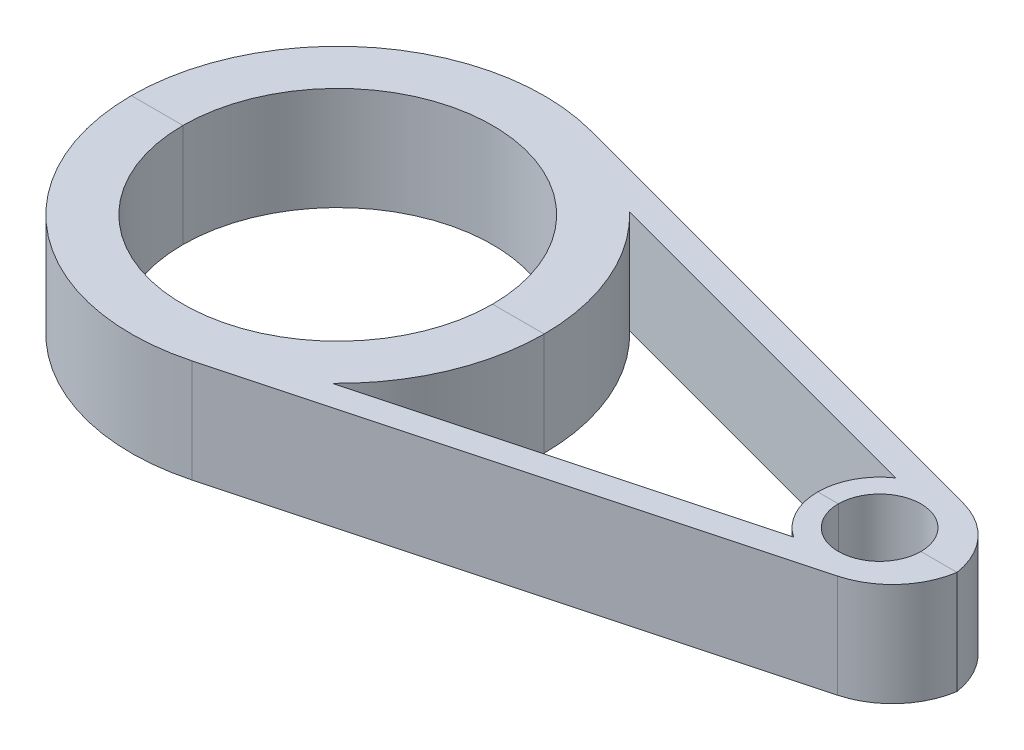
ISO-10303-21;
HEADER;
FILE_DESCRIPTION(('STEP AP214'),'2;1');
FILE_NAME('part.step','',(''),(''),'','','');
FILE_SCHEMA(('AUTOMOTIVE_DESIGN { 1 0 10303 214 1 1 1 1 }'));
ENDSEC;
DATA;
#1=APPLICATION_CONTEXT('core data for automotive mechanical design processes');
#2=APPLICATION_PROTOCOL_DEFINITION('international standard','automotive_design',2000,#1);
#3=PRODUCT_CONTEXT('',#1,'mechanical');
#4=PRODUCT('Part','Part','',(#3));
#5=PRODUCT_RELATED_PRODUCT_CATEGORY('part','',(#4));
#6=PRODUCT_DEFINITION_FORMATION('','',#4);
#7=PRODUCT_DEFINITION_CONTEXT('part definition',#1,'design');
#8=PRODUCT_DEFINITION('design','',#6,#7);
#9=PRODUCT_DEFINITION_SHAPE('','',#8);
#10=(LENGTH_UNIT() NAMED_UNIT(*) SI_UNIT(.MILLI.,.METRE.));
#11=(NAMED_UNIT(*) PLANE_ANGLE_UNIT() SI_UNIT($,.RADIAN.));
#12=(NAMED_UNIT(*) SI_UNIT($,.STERADIAN.) SOLID_ANGLE_UNIT());
#13=UNCERTAINTY_MEASURE_WITH_UNIT(LENGTH_MEASURE(1.E-05),#10,'distance_accuracy_value','');
#14=(GEOMETRIC_REPRESENTATION_CONTEXT(3) GLOBAL_UNCERTAINTY_ASSIGNED_CONTEXT((#13)) GLOBAL_UNIT_ASSIGNED_CONTEXT((#10,
#11,#12)) REPRESENTATION_CONTEXT('',''));
#15=CARTESIAN_POINT('',(0.,0.,0.));
#16=DIRECTION('',(0.,0.,1.));
#17=DIRECTION('',(1.,0.,0.));
#18=AXIS2_PLACEMENT_3D('',#15,#16,#17);
#19=CARTESIAN_POINT('',(97.,20.,0.));
#20=DIRECTION('',(0.,0.,1.));
#21=DIRECTION('',(-1.,0.,0.));
#22=AXIS2_PLACEMENT_3D('',#19,#20,#21);
#23=PLANE('',#22);
#24=DIRECTION('',(1.,0.,0.));
#25=VECTOR('',#24,1.);
#26=CARTESIAN_POINT('',(97.,20.,0.));
#27=LINE('',#26,#25);
#28=CARTESIAN_POINT('',(93.,20.,0.));
#29=VERTEX_POINT('',#28);
#30=CARTESIAN_POINT('',(97.,20.,0.));
#31=VERTEX_POINT('',#30);
#32=EDGE_CURVE('E150',#29,#31,#27,.T.);
#33=ORIENTED_EDGE('',*,*,#32,.T.);
#34=DIRECTION('',(0.,-1.,0.));
#35=VECTOR('',#34,1.);
#36=CARTESIAN_POINT('',(97.,20.,0.));
#37=LINE('',#36,#35);
#38=CARTESIAN_POINT('',(97.,0.,0.));
#39=VERTEX_POINT('',#38);
#40=EDGE_CURVE('E224',#31,#39,#37,.T.);
#41=ORIENTED_EDGE('',*,*,#40,.T.);
#42=DIRECTION('',(1.,0.,0.));
#43=VECTOR('',#42,1.);
#44=CARTESIAN_POINT('',(97.,0.,0.));
#45=LINE('',#44,#43);
#46=CARTESIAN_POINT('',(93.,0.,0.));
#47=VERTEX_POINT('',#46);
#48=EDGE_CURVE('E176',#47,#39,#45,.T.);
#49=ORIENTED_EDGE('',*,*,#48,.F.);
#50=DIRECTION('',(0.,1.,0.));
#51=VECTOR('',#50,1.);
#52=CARTESIAN_POINT('',(93.,0.,0.));
#53=LINE('',#52,#51);
#54=EDGE_CURVE('E161',#47,#29,#53,.T.);
#55=ORIENTED_EDGE('',*,*,#54,.T.);
#56=EDGE_LOOP('',(#33,#41,#49,#55));
#57=FACE_BOUND('',#56,.T.);
#58=ADVANCED_FACE('F43',(#57),#23,.F.);
#59=CARTESIAN_POINT('',(0.,20.,0.));
#60=DIRECTION('',(0.,-1.,0.));
#61=DIRECTION('',(0.,0.,1.));
#62=AXIS2_PLACEMENT_3D('',#59,#60,#61);
#63=CYLINDRICAL_SURFACE('',#62,40.);
#64=CARTESIAN_POINT('',(0.,0.,0.));
#65=DIRECTION('',(0.,-1.,0.));
#66=DIRECTION('',(0.,0.,1.));
#67=AXIS2_PLACEMENT_3D('',#64,#65,#66);
#68=CIRCLE('',#67,40.);
#69=CARTESIAN_POINT('',(10.3527618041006,0.,38.6370330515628));
#70=VERTEX_POINT('',#69);
#71=CARTESIAN_POINT('',(-40.,0.,0.));
#72=VERTEX_POINT('',#71);
#73=EDGE_CURVE('E163',#70,#72,#68,.T.);
#74=ORIENTED_EDGE('',*,*,#73,.F.);
#75=DIRECTION('',(0.,-1.,0.));
#76=VECTOR('',#75,1.);
#77=CARTESIAN_POINT('',(10.3527618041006,20.,38.6370330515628));
#78=LINE('',#77,#76);
#79=CARTESIAN_POINT('',(10.3527618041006,20.,38.6370330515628));
#80=VERTEX_POINT('',#79);
#81=EDGE_CURVE('E213',#80,#70,#78,.T.);
#82=ORIENTED_EDGE('',*,*,#81,.F.);
#83=CARTESIAN_POINT('',(0.,20.,0.));
#84=DIRECTION('',(0.,-1.,0.));
#85=DIRECTION('',(0.,0.,1.));
#86=AXIS2_PLACEMENT_3D('',#83,#84,#85);
#87=CIRCLE('',#86,40.);
#88=CARTESIAN_POINT('',(-40.,20.,0.));
#89=VERTEX_POINT('',#88);
#90=EDGE_CURVE('E191',#80,#89,#87,.T.);
#91=ORIENTED_EDGE('',*,*,#90,.T.);
#92=DIRECTION('',(0.,-1.,0.));
#93=VECTOR('',#92,1.);
#94=CARTESIAN_POINT('',(-40.,20.,0.));
#95=LINE('',#94,#93);
#96=EDGE_CURVE('E12',#89,#72,#95,.T.);
#97=ORIENTED_EDGE('',*,*,#96,.T.);
#98=EDGE_LOOP('',(#74,#82,#91,#97));
#99=FACE_BOUND('',#98,.T.);
#100=ADVANCED_FACE('F45',(#99),#63,.T.);
#101=CARTESIAN_POINT('',(-30.,20.,0.));
#102=DIRECTION('',(0.,0.,1.));
#103=DIRECTION('',(-1.,0.,0.));
#104=AXIS2_PLACEMENT_3D('',#101,#102,#103);
#105=PLANE('',#104);
#106=DIRECTION('',(1.,0.,0.));
#107=VECTOR('',#106,1.);
#108=CARTESIAN_POINT('',(-30.,0.,0.));
#109=LINE('',#108,#107);
#110=CARTESIAN_POINT('',(-30.,0.,0.));
#111=VERTEX_POINT('',#110);
#112=EDGE_CURVE('E170',#72,#111,#109,.T.);
#113=ORIENTED_EDGE('',*,*,#112,.F.);
#114=ORIENTED_EDGE('',*,*,#96,.F.);
#115=DIRECTION('',(1.,0.,0.));
#116=VECTOR('',#115,1.);
#117=CARTESIAN_POINT('',(-30.,20.,0.));
#118=LINE('',#117,#116);
#119=CARTESIAN_POINT('',(-30.,20.,0.));
#120=VERTEX_POINT('',#119);
#121=EDGE_CURVE('E194',#89,#120,#118,.T.);
#122=ORIENTED_EDGE('',*,*,#121,.T.);
#123=DIRECTION('',(0.,-1.,0.));
#124=VECTOR('',#123,1.);
#125=CARTESIAN_POINT('',(-30.,20.,0.));
#126=LINE('',#125,#124);
#127=EDGE_CURVE('E51',#120,#111,#126,.T.);
#128=ORIENTED_EDGE('',*,*,#127,.T.);
#129=EDGE_LOOP('',(#113,#114,#122,#128));
#130=FACE_BOUND('',#129,.T.);
#131=ADVANCED_FACE('F232',(#130),#105,.F.);
#132=CARTESIAN_POINT('',(0.,20.,0.));
#133=DIRECTION('',(0.,-1.,0.));
#134=DIRECTION('',(0.,0.,1.));
#135=AXIS2_PLACEMENT_3D('',#132,#133,#134);
#136=CYLINDRICAL_SURFACE('',#135,30.);
#137=CARTESIAN_POINT('',(0.,0.,0.));
#138=DIRECTION('',(0.,1.,0.));
#139=DIRECTION('',(0.,0.,1.));
#140=AXIS2_PLACEMENT_3D('',#137,#138,#139);
#141=CIRCLE('',#140,30.);
#142=CARTESIAN_POINT('',(30.,0.,0.));
#143=VERTEX_POINT('',#142);
#144=EDGE_CURVE('E173',#111,#143,#141,.T.);
#145=ORIENTED_EDGE('',*,*,#144,.F.);
#146=ORIENTED_EDGE('',*,*,#127,.F.);
#147=CARTESIAN_POINT('',(0.,20.,0.));
#148=DIRECTION('',(0.,1.,0.));
#149=DIRECTION('',(0.,0.,1.));
#150=AXIS2_PLACEMENT_3D('',#147,#148,#149);
#151=CIRCLE('',#150,30.);
#152=CARTESIAN_POINT('',(30.,20.,0.));
#153=VERTEX_POINT('',#152);
#154=EDGE_CURVE('E197',#120,#153,#151,.T.);
#155=ORIENTED_EDGE('',*,*,#154,.T.);
#156=DIRECTION('',(0.,-1.,0.));
#157=VECTOR('',#156,1.);
#158=CARTESIAN_POINT('',(30.,20.,0.));
#159=LINE('',#158,#157);
#160=EDGE_CURVE('E227',#153,#143,#159,.T.);
#161=ORIENTED_EDGE('',*,*,#160,.T.);
#162=EDGE_LOOP('',(#145,#146,#155,#161));
#163=FACE_BOUND('',#162,.T.);
#164=ADVANCED_FACE('F241',(#163),#136,.F.);
#165=CARTESIAN_POINT('',(40.,0.,0.));
#166=VERTEX_POINT('',#165);
#167=EDGE_CURVE('E177',#143,#166,#45,.T.);
#168=ORIENTED_EDGE('',*,*,#167,.F.);
#169=ORIENTED_EDGE('',*,*,#160,.F.);
#170=CARTESIAN_POINT('',(40.,20.,0.));
#171=VERTEX_POINT('',#170);
#172=EDGE_CURVE('E200',#153,#171,#27,.T.);
#173=ORIENTED_EDGE('',*,*,#172,.T.);
#174=DIRECTION('',(0.,1.,0.));
#175=VECTOR('',#174,1.);
#176=CARTESIAN_POINT('',(40.,0.,0.));
#177=LINE('',#176,#175);
#178=EDGE_CURVE('E164',#166,#171,#177,.T.);
#179=ORIENTED_EDGE('',*,*,#178,.F.);
#180=EDGE_LOOP('',(#168,#169,#173,#179));
#181=FACE_BOUND('',#180,.T.);
#182=ADVANCED_FACE('F243',(#181),#23,.F.);
#183=CARTESIAN_POINT('',(105.,20.,0.));
#184=DIRECTION('',(0.,-1.,0.));
#185=DIRECTION('',(0.,0.,1.));
#186=AXIS2_PLACEMENT_3D('',#183,#184,#185);
#187=CYLINDRICAL_SURFACE('',#186,7.99999999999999);
#188=CARTESIAN_POINT('',(105.,0.,0.));
#189=DIRECTION('',(0.,1.,0.));
#190=DIRECTION('',(0.,0.,1.));
#191=AXIS2_PLACEMENT_3D('',#188,#189,#190);
#192=CIRCLE('',#191,7.99999999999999);
#193=CARTESIAN_POINT('',(113.,0.,0.));
#194=VERTEX_POINT('',#193);
#195=EDGE_CURVE('E180',#39,#194,#192,.T.);
#196=ORIENTED_EDGE('',*,*,#195,.F.);
#197=ORIENTED_EDGE('',*,*,#40,.F.);
#198=CARTESIAN_POINT('',(105.,20.,0.));
#199=DIRECTION('',(0.,1.,0.));
#200=DIRECTION('',(0.,0.,1.));
#201=AXIS2_PLACEMENT_3D('',#198,#199,#200);
#202=CIRCLE('',#201,7.99999999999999);
#203=CARTESIAN_POINT('',(113.,20.,0.));
#204=VERTEX_POINT('',#203);
#205=EDGE_CURVE('E203',#31,#204,#202,.T.);
#206=ORIENTED_EDGE('',*,*,#205,.T.);
#207=DIRECTION('',(0.,-1.,0.));
#208=VECTOR('',#207,1.);
#209=CARTESIAN_POINT('',(113.,20.,0.));
#210=LINE('',#209,#208);
#211=EDGE_CURVE('E221',#204,#194,#210,.T.);
#212=ORIENTED_EDGE('',*,*,#211,.T.);
#213=EDGE_LOOP('',(#196,#197,#206,#212));
#214=FACE_BOUND('',#213,.T.);
#215=ADVANCED_FACE('F264',(#214),#187,.F.);
#216=CARTESIAN_POINT('',(120.,20.,-1.03141099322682E-13));
#217=DIRECTION('',(0.,0.,1.));
#218=DIRECTION('',(-1.,0.,0.));
#219=AXIS2_PLACEMENT_3D('',#216,#217,#218);
#220=PLANE('',#219);
#221=DIRECTION('',(1.,0.,0.));
#222=VECTOR('',#221,1.);
#223=CARTESIAN_POINT('',(120.,0.,-1.03141099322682E-13));
#224=LINE('',#223,#222);
#225=CARTESIAN_POINT('',(120.,0.,-1.03141099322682E-13));
#226=VERTEX_POINT('',#225);
#227=EDGE_CURVE('E183',#194,#226,#224,.T.);
#228=ORIENTED_EDGE('',*,*,#227,.F.);
#229=ORIENTED_EDGE('',*,*,#211,.F.);
#230=DIRECTION('',(1.,0.,0.));
#231=VECTOR('',#230,1.);
#232=CARTESIAN_POINT('',(120.,20.,-1.03141099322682E-13));
#233=LINE('',#232,#231);
#234=CARTESIAN_POINT('',(120.,20.,-1.03141099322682E-13));
#235=VERTEX_POINT('',#234);
#236=EDGE_CURVE('E206',#204,#235,#233,.T.);
#237=ORIENTED_EDGE('',*,*,#236,.T.);
#238=DIRECTION('',(0.,-1.,0.));
#239=VECTOR('',#238,1.);
#240=CARTESIAN_POINT('',(120.,20.,-1.03141099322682E-13));
#241=LINE('',#240,#239);
#242=EDGE_CURVE('E218',#235,#226,#241,.T.);
#243=ORIENTED_EDGE('',*,*,#242,.T.);
#244=EDGE_LOOP('',(#228,#229,#237,#243));
#245=FACE_BOUND('',#244,.T.);
#246=ADVANCED_FACE('F269',(#245),#220,.F.);
#247=CARTESIAN_POINT('',(105.177429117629,20.,-2.30030268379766));
#248=DIRECTION('',(0.,-1.,0.));
#249=DIRECTION('',(0.,0.,1.));
#250=AXIS2_PLACEMENT_3D('',#247,#248,#249);
#251=CYLINDRICAL_SURFACE('',#250,15.);
#252=CARTESIAN_POINT('',(105.177429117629,0.,-2.30030268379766));
#253=DIRECTION('',(0.,-1.,0.));
#254=DIRECTION('',(0.,0.,1.));
#255=AXIS2_PLACEMENT_3D('',#252,#253,#254);
#256=CIRCLE('',#255,15.);
#257=CARTESIAN_POINT('',(109.059714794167,0.,12.1885847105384));
#258=VERTEX_POINT('',#257);
#259=EDGE_CURVE('E186',#226,#258,#256,.T.);
#260=ORIENTED_EDGE('',*,*,#259,.F.);
#261=ORIENTED_EDGE('',*,*,#242,.F.);
#262=CARTESIAN_POINT('',(105.177429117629,20.,-2.30030268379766));
#263=DIRECTION('',(0.,-1.,0.));
#264=DIRECTION('',(0.,0.,1.));
#265=AXIS2_PLACEMENT_3D('',#262,#263,#264);
#266=CIRCLE('',#265,15.);
#267=CARTESIAN_POINT('',(109.059714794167,20.,12.1885847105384));
#268=VERTEX_POINT('',#267);
#269=EDGE_CURVE('E209',#235,#268,#266,.T.);
#270=ORIENTED_EDGE('',*,*,#269,.T.);
#271=DIRECTION('',(0.,-1.,0.));
#272=VECTOR('',#271,1.);
#273=CARTESIAN_POINT('',(109.059714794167,20.,12.1885847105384));
#274=LINE('',#273,#272);
#275=EDGE_CURVE('E215',#268,#258,#274,.T.);
#276=ORIENTED_EDGE('',*,*,#275,.T.);
#277=EDGE_LOOP('',(#260,#261,#270,#276));
#278=FACE_BOUND('',#277,.T.);
#279=ADVANCED_FACE('F309',(#278),#251,.T.);
#280=CARTESIAN_POINT('',(10.3527618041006,20.,38.6370330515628));
#281=DIRECTION('',(-0.258819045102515,0.,-0.96592582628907));
#282=DIRECTION('',(0.96592582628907,0.,-0.258819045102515));
#283=AXIS2_PLACEMENT_3D('',#280,#281,#282);
#284=PLANE('',#283);
#285=DIRECTION('',(-0.96592582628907,0.,0.258819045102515));
#286=VECTOR('',#285,1.);
#287=CARTESIAN_POINT('',(10.3527618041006,0.,38.6370330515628));
#288=LINE('',#287,#286);
#289=EDGE_CURVE('E189',#258,#70,#288,.T.);
#290=ORIENTED_EDGE('',*,*,#289,.F.);
#291=ORIENTED_EDGE('',*,*,#275,.F.);
#292=DIRECTION('',(-0.96592582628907,0.,0.258819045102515));
#293=VECTOR('',#292,1.);
#294=CARTESIAN_POINT('',(10.3527618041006,20.,38.6370330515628));
#295=LINE('',#294,#293);
#296=EDGE_CURVE('E66',#268,#80,#295,.T.);
#297=ORIENTED_EDGE('',*,*,#296,.T.);
#298=ORIENTED_EDGE('',*,*,#81,.T.);
#299=EDGE_LOOP('',(#290,#291,#297,#298));
#300=FACE_BOUND('',#299,.T.);
#301=ADVANCED_FACE('F318',(#300),#284,.F.);
#302=CARTESIAN_POINT('',(0.,20.,0.));
#303=DIRECTION('',(0.,-1.,0.));
#304=DIRECTION('',(0.,0.,1.));
#305=AXIS2_PLACEMENT_3D('',#302,#303,#304);
#306=PLANE('',#305);
#307=DIRECTION('',(-0.96592582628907,0.,0.258819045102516));
#308=VECTOR('',#307,1.);
#309=CARTESIAN_POINT('',(98.2364011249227,20.,9.91230196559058));
#310=LINE('',#309,#308);
#311=CARTESIAN_POINT('',(98.2364011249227,20.,9.91230196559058));
#312=VERTEX_POINT('',#311);
#313=CARTESIAN_POINT('',(27.763739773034,20.,28.7953946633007));
#314=VERTEX_POINT('',#313);
#315=EDGE_CURVE('E148',#312,#314,#310,.T.);
#316=ORIENTED_EDGE('',*,*,#315,.T.);
#317=CARTESIAN_POINT('',(0.,20.,0.));
#318=DIRECTION('',(0.,1.,0.));
#319=DIRECTION('',(0.,0.,-1.));
#320=AXIS2_PLACEMENT_3D('',#317,#318,#319);
#321=CIRCLE('',#320,40.);
#322=EDGE_CURVE('E153',#314,#171,#321,.T.);
#323=ORIENTED_EDGE('',*,*,#322,.T.);
#324=ORIENTED_EDGE('',*,*,#172,.F.);
#325=ORIENTED_EDGE('',*,*,#154,.F.);
#326=ORIENTED_EDGE('',*,*,#121,.F.);
#327=ORIENTED_EDGE('',*,*,#90,.F.);
#328=ORIENTED_EDGE('',*,*,#296,.F.);
#329=ORIENTED_EDGE('',*,*,#269,.F.);
#330=ORIENTED_EDGE('',*,*,#236,.F.);
#331=ORIENTED_EDGE('',*,*,#205,.F.);
#332=ORIENTED_EDGE('',*,*,#32,.F.);
#333=CARTESIAN_POINT('',(105.,20.,0.));
#334=DIRECTION('',(0.,1.,0.));
#335=DIRECTION('',(0.,0.,-1.));
#336=AXIS2_PLACEMENT_3D('',#333,#334,#335);
#337=CIRCLE('',#336,12.);
#338=EDGE_CURVE('E136',#29,#312,#337,.T.);
#339=ORIENTED_EDGE('',*,*,#338,.T.);
#340=EDGE_LOOP('',(#316,#323,#324,#325,#326,#327,#328,#329,#330,#331,#332,#339));
#341=FACE_BOUND('',#340,.T.);
#342=ADVANCED_FACE('F147',(#341),#306,.F.);
#343=CARTESIAN_POINT('',(0.,0.,0.));
#344=DIRECTION('',(0.,-1.,0.));
#345=DIRECTION('',(0.,0.,1.));
#346=AXIS2_PLACEMENT_3D('',#343,#344,#345);
#347=PLANE('',#346);
#348=CARTESIAN_POINT('',(105.,0.,0.));
#349=DIRECTION('',(0.,1.,0.));
#350=DIRECTION('',(0.,0.,-1.));
#351=AXIS2_PLACEMENT_3D('',#348,#349,#350);
#352=CIRCLE('',#351,12.);
#353=CARTESIAN_POINT('',(98.2364011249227,0.,9.91230196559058));
#354=VERTEX_POINT('',#353);
#355=EDGE_CURVE('E138',#47,#354,#352,.T.);
#356=ORIENTED_EDGE('',*,*,#355,.F.);
#357=ORIENTED_EDGE('',*,*,#48,.T.);
#358=ORIENTED_EDGE('',*,*,#195,.T.);
#359=ORIENTED_EDGE('',*,*,#227,.T.);
#360=ORIENTED_EDGE('',*,*,#259,.T.);
#361=ORIENTED_EDGE('',*,*,#289,.T.);
#362=ORIENTED_EDGE('',*,*,#73,.T.);
#363=ORIENTED_EDGE('',*,*,#112,.T.);
#364=ORIENTED_EDGE('',*,*,#144,.T.);
#365=ORIENTED_EDGE('',*,*,#167,.T.);
#366=CARTESIAN_POINT('',(0.,0.,0.));
#367=DIRECTION('',(0.,1.,0.));
#368=DIRECTION('',(0.,0.,-1.));
#369=AXIS2_PLACEMENT_3D('',#366,#367,#368);
#370=CIRCLE('',#369,40.);
#371=CARTESIAN_POINT('',(27.763739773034,0.,28.7953946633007));
#372=VERTEX_POINT('',#371);
#373=EDGE_CURVE('E142',#372,#166,#370,.T.);
#374=ORIENTED_EDGE('',*,*,#373,.F.);
#375=DIRECTION('',(-0.96592582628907,0.,0.258819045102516));
#376=VECTOR('',#375,1.);
#377=CARTESIAN_POINT('',(98.2364011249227,0.,9.91230196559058));
#378=LINE('',#377,#376);
#379=EDGE_CURVE('E158',#354,#372,#378,.T.);
#380=ORIENTED_EDGE('',*,*,#379,.F.);
#381=EDGE_LOOP('',(#356,#357,#358,#359,#360,#361,#362,#363,#364,#365,#374,#380));
#382=FACE_BOUND('',#381,.T.);
#383=ADVANCED_FACE('F236',(#382),#347,.T.);
#384=CARTESIAN_POINT('',(105.,0.,0.));
#385=DIRECTION('',(0.,1.,0.));
#386=DIRECTION('',(0.,0.,-1.));
#387=AXIS2_PLACEMENT_3D('',#384,#385,#386);
#388=CYLINDRICAL_SURFACE('',#387,12.);
#389=ORIENTED_EDGE('',*,*,#338,.F.);
#390=ORIENTED_EDGE('',*,*,#54,.F.);
#391=ORIENTED_EDGE('',*,*,#355,.T.);
#392=DIRECTION('',(0.,1.,0.));
#393=VECTOR('',#392,1.);
#394=CARTESIAN_POINT('',(98.2364011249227,0.,9.91230196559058));
#395=LINE('',#394,#393);
#396=EDGE_CURVE('E132',#354,#312,#395,.T.);
#397=ORIENTED_EDGE('',*,*,#396,.T.);
#398=EDGE_LOOP('',(#389,#390,#391,#397));
#399=FACE_BOUND('',#398,.T.);
#400=ADVANCED_FACE('F134',(#399),#388,.T.);
#401=CARTESIAN_POINT('',(0.,0.,0.));
#402=DIRECTION('',(0.,1.,0.));
#403=DIRECTION('',(0.,0.,-1.));
#404=AXIS2_PLACEMENT_3D('',#401,#402,#403);
#405=CYLINDRICAL_SURFACE('',#404,40.);
#406=ORIENTED_EDGE('',*,*,#322,.F.);
#407=DIRECTION('',(0.,1.,0.));
#408=VECTOR('',#407,1.);
#409=CARTESIAN_POINT('',(27.763739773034,0.,28.7953946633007));
#410=LINE('',#409,#408);
#411=EDGE_CURVE('E58',#372,#314,#410,.T.);
#412=ORIENTED_EDGE('',*,*,#411,.F.);
#413=ORIENTED_EDGE('',*,*,#373,.T.);
#414=ORIENTED_EDGE('',*,*,#178,.T.);
#415=EDGE_LOOP('',(#406,#412,#413,#414));
#416=FACE_BOUND('',#415,.T.);
#417=ADVANCED_FACE('F246',(#416),#405,.T.);
#418=CARTESIAN_POINT('',(98.2364011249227,0.,9.91230196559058));
#419=DIRECTION('',(0.258819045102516,0.,0.96592582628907));
#420=DIRECTION('',(-0.96592582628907,0.,0.258819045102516));
#421=AXIS2_PLACEMENT_3D('',#418,#419,#420);
#422=PLANE('',#421);
#423=ORIENTED_EDGE('',*,*,#315,.F.);
#424=ORIENTED_EDGE('',*,*,#396,.F.);
#425=ORIENTED_EDGE('',*,*,#379,.T.);
#426=ORIENTED_EDGE('',*,*,#411,.T.);
#427=EDGE_LOOP('',(#423,#424,#425,#426));
#428=FACE_BOUND('',#427,.T.);
#429=ADVANCED_FACE('F152',(#428),#422,.F.);
#430=CLOSED_SHELL('',(#58,#100,#131,#164,#182,#215,#246,#279,#301,#342,#383,#400,#417,#429));
#431=MANIFOLD_SOLID_BREP('B2',#430);
#432=CARTESIAN_POINT('',(97.,20.,0.));
#433=DIRECTION('',(0.,0.,-1.));
#434=DIRECTION('',(-1.,0.,0.));
#435=AXIS2_PLACEMENT_3D('',#432,#433,#434);
#436=PLANE('',#435);
#437=DIRECTION('',(1.,0.,0.));
#438=VECTOR('',#437,1.);
#439=CARTESIAN_POINT('',(97.,20.,0.));
#440=LINE('',#439,#438);
#441=CARTESIAN_POINT('',(93.,20.,0.));
#442=VERTEX_POINT('',#441);
#443=CARTESIAN_POINT('',(97.,20.,0.));
#444=VERTEX_POINT('',#443);
#445=EDGE_CURVE('E521',#442,#444,#440,.T.);
#446=ORIENTED_EDGE('',*,*,#445,.F.);
#447=DIRECTION('',(0.,1.,0.));
#448=VECTOR('',#447,1.);
#449=CARTESIAN_POINT('',(93.,0.,0.));
#450=LINE('',#449,#448);
#451=CARTESIAN_POINT('',(93.,0.,0.));
#452=VERTEX_POINT('',#451);
#453=EDGE_CURVE('E478',#452,#442,#450,.T.);
#454=ORIENTED_EDGE('',*,*,#453,.F.);
#455=DIRECTION('',(1.,0.,0.));
#456=VECTOR('',#455,1.);
#457=CARTESIAN_POINT('',(97.,0.,0.));
#458=LINE('',#457,#456);
#459=CARTESIAN_POINT('',(97.,0.,0.));
#460=VERTEX_POINT('',#459);
#461=EDGE_CURVE('E503',#452,#460,#458,.T.);
#462=ORIENTED_EDGE('',*,*,#461,.T.);
#463=DIRECTION('',(0.,-1.,0.));
#464=VECTOR('',#463,1.);
#465=CARTESIAN_POINT('',(97.,20.,0.));
#466=LINE('',#465,#464);
#467=EDGE_CURVE('E543',#444,#460,#466,.T.);
#468=ORIENTED_EDGE('',*,*,#467,.F.);
#469=EDGE_LOOP('',(#446,#454,#462,#468));
#470=FACE_BOUND('',#469,.T.);
#471=ADVANCED_FACE('F372',(#470),#436,.F.);
#472=CARTESIAN_POINT('',(0.,20.,0.));
#473=DIRECTION('',(0.,-1.,0.));
#474=DIRECTION('',(0.,0.,-1.));
#475=AXIS2_PLACEMENT_3D('',#472,#473,#474);
#476=CYLINDRICAL_SURFACE('',#475,40.);
#477=CARTESIAN_POINT('',(0.,0.,0.));
#478=DIRECTION('',(0.,1.,0.));
#479=DIRECTION('',(0.,0.,-1.));
#480=AXIS2_PLACEMENT_3D('',#477,#478,#479);
#481=CIRCLE('',#480,40.);
#482=CARTESIAN_POINT('',(10.3527618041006,0.,-38.6370330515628));
#483=VERTEX_POINT('',#482);
#484=CARTESIAN_POINT('',(-40.,0.,0.));
#485=VERTEX_POINT('',#484);
#486=EDGE_CURVE('E492',#483,#485,#481,.T.);
#487=ORIENTED_EDGE('',*,*,#486,.T.);
#488=DIRECTION('',(0.,-1.,0.));
#489=VECTOR('',#488,1.);
#490=CARTESIAN_POINT('',(-40.,20.,0.));
#491=LINE('',#490,#489);
#492=CARTESIAN_POINT('',(-40.,20.,0.));
#493=VERTEX_POINT('',#492);
#494=EDGE_CURVE('E41',#493,#485,#491,.T.);
#495=ORIENTED_EDGE('',*,*,#494,.F.);
#496=CARTESIAN_POINT('',(0.,20.,0.));
#497=DIRECTION('',(0.,1.,0.));
#498=DIRECTION('',(0.,0.,-1.));
#499=AXIS2_PLACEMENT_3D('',#496,#497,#498);
#500=CIRCLE('',#499,40.);
#501=CARTESIAN_POINT('',(10.3527618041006,20.,-38.6370330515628));
#502=VERTEX_POINT('',#501);
#503=EDGE_CURVE('E515',#502,#493,#500,.T.);
#504=ORIENTED_EDGE('',*,*,#503,.F.);
#505=DIRECTION('',(0.,-1.,0.));
#506=VECTOR('',#505,1.);
#507=CARTESIAN_POINT('',(10.3527618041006,20.,-38.6370330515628));
#508=LINE('',#507,#506);
#509=EDGE_CURVE('E531',#502,#483,#508,.T.);
#510=ORIENTED_EDGE('',*,*,#509,.T.);
#511=EDGE_LOOP('',(#487,#495,#504,#510));
#512=FACE_BOUND('',#511,.T.);
#513=ADVANCED_FACE('F374',(#512),#476,.T.);
#514=CARTESIAN_POINT('',(-30.,20.,0.));
#515=DIRECTION('',(0.,0.,-1.));
#516=DIRECTION('',(-1.,0.,0.));
#517=AXIS2_PLACEMENT_3D('',#514,#515,#516);
#518=PLANE('',#517);
#519=DIRECTION('',(1.,0.,0.));
#520=VECTOR('',#519,1.);
#521=CARTESIAN_POINT('',(-30.,0.,0.));
#522=LINE('',#521,#520);
#523=CARTESIAN_POINT('',(-30.,0.,0.));
#524=VERTEX_POINT('',#523);
#525=EDGE_CURVE('E499',#485,#524,#522,.T.);
#526=ORIENTED_EDGE('',*,*,#525,.T.);
#527=DIRECTION('',(0.,-1.,0.));
#528=VECTOR('',#527,1.);
#529=CARTESIAN_POINT('',(-30.,20.,0.));
#530=LINE('',#529,#528);
#531=CARTESIAN_POINT('',(-30.,20.,0.));
#532=VERTEX_POINT('',#531);
#533=EDGE_CURVE('E380',#532,#524,#530,.T.);
#534=ORIENTED_EDGE('',*,*,#533,.F.);
#535=DIRECTION('',(1.,0.,0.));
#536=VECTOR('',#535,1.);
#537=CARTESIAN_POINT('',(-30.,20.,0.));
#538=LINE('',#537,#536);
#539=EDGE_CURVE('E517',#493,#532,#538,.T.);
#540=ORIENTED_EDGE('',*,*,#539,.F.);
#541=ORIENTED_EDGE('',*,*,#494,.T.);
#542=EDGE_LOOP('',(#526,#534,#540,#541));
#543=FACE_BOUND('',#542,.T.);
#544=ADVANCED_FACE('F565',(#543),#518,.F.);
#545=CARTESIAN_POINT('',(0.,20.,0.));
#546=DIRECTION('',(0.,-1.,0.));
#547=DIRECTION('',(0.,0.,-1.));
#548=AXIS2_PLACEMENT_3D('',#545,#546,#547);
#549=CYLINDRICAL_SURFACE('',#548,30.);
#550=CARTESIAN_POINT('',(0.,0.,0.));
#551=DIRECTION('',(0.,-1.,0.));
#552=DIRECTION('',(0.,0.,-1.));
#553=AXIS2_PLACEMENT_3D('',#550,#551,#552);
#554=CIRCLE('',#553,30.);
#555=CARTESIAN_POINT('',(30.,0.,0.));
#556=VERTEX_POINT('',#555);
#557=EDGE_CURVE('E501',#524,#556,#554,.T.);
#558=ORIENTED_EDGE('',*,*,#557,.T.);
#559=DIRECTION('',(0.,-1.,0.));
#560=VECTOR('',#559,1.);
#561=CARTESIAN_POINT('',(30.,20.,0.));
#562=LINE('',#561,#560);
#563=CARTESIAN_POINT('',(30.,20.,0.));
#564=VERTEX_POINT('',#563);
#565=EDGE_CURVE('E546',#564,#556,#562,.T.);
#566=ORIENTED_EDGE('',*,*,#565,.F.);
#567=CARTESIAN_POINT('',(0.,20.,0.));
#568=DIRECTION('',(0.,-1.,0.));
#569=DIRECTION('',(0.,0.,-1.));
#570=AXIS2_PLACEMENT_3D('',#567,#568,#569);
#571=CIRCLE('',#570,30.);
#572=EDGE_CURVE('E519',#532,#564,#571,.T.);
#573=ORIENTED_EDGE('',*,*,#572,.F.);
#574=ORIENTED_EDGE('',*,*,#533,.T.);
#575=EDGE_LOOP('',(#558,#566,#573,#574));
#576=FACE_BOUND('',#575,.T.);
#577=ADVANCED_FACE('F553',(#576),#549,.F.);
#578=CARTESIAN_POINT('',(40.,0.,0.));
#579=VERTEX_POINT('',#578);
#580=EDGE_CURVE('E504',#556,#579,#458,.T.);
#581=ORIENTED_EDGE('',*,*,#580,.T.);
#582=DIRECTION('',(0.,1.,0.));
#583=VECTOR('',#582,1.);
#584=CARTESIAN_POINT('',(40.,0.,0.));
#585=LINE('',#584,#583);
#586=CARTESIAN_POINT('',(40.,20.,0.));
#587=VERTEX_POINT('',#586);
#588=EDGE_CURVE('E493',#579,#587,#585,.T.);
#589=ORIENTED_EDGE('',*,*,#588,.T.);
#590=EDGE_CURVE('E522',#564,#587,#440,.T.);
#591=ORIENTED_EDGE('',*,*,#590,.F.);
#592=ORIENTED_EDGE('',*,*,#565,.T.);
#593=EDGE_LOOP('',(#581,#589,#591,#592));
#594=FACE_BOUND('',#593,.T.);
#595=ADVANCED_FACE('F561',(#594),#436,.F.);
#596=CARTESIAN_POINT('',(105.,20.,0.));
#597=DIRECTION('',(0.,-1.,0.));
#598=DIRECTION('',(0.,0.,-1.));
#599=AXIS2_PLACEMENT_3D('',#596,#597,#598);
#600=CYLINDRICAL_SURFACE('',#599,7.99999999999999);
#601=CARTESIAN_POINT('',(105.,0.,0.));
#602=DIRECTION('',(0.,-1.,0.));
#603=DIRECTION('',(0.,0.,-1.));
#604=AXIS2_PLACEMENT_3D('',#601,#602,#603);
#605=CIRCLE('',#604,7.99999999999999);
#606=CARTESIAN_POINT('',(113.,0.,0.));
#607=VERTEX_POINT('',#606);
#608=EDGE_CURVE('E507',#460,#607,#605,.T.);
#609=ORIENTED_EDGE('',*,*,#608,.T.);
#610=DIRECTION('',(0.,-1.,0.));
#611=VECTOR('',#610,1.);
#612=CARTESIAN_POINT('',(113.,20.,0.));
#613=LINE('',#612,#611);
#614=CARTESIAN_POINT('',(113.,20.,0.));
#615=VERTEX_POINT('',#614);
#616=EDGE_CURVE('E540',#615,#607,#613,.T.);
#617=ORIENTED_EDGE('',*,*,#616,.F.);
#618=CARTESIAN_POINT('',(105.,20.,0.));
#619=DIRECTION('',(0.,-1.,0.));
#620=DIRECTION('',(0.,0.,-1.));
#621=AXIS2_PLACEMENT_3D('',#618,#619,#620);
#622=CIRCLE('',#621,7.99999999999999);
#623=EDGE_CURVE('E524',#444,#615,#622,.T.);
#624=ORIENTED_EDGE('',*,*,#623,.F.);
#625=ORIENTED_EDGE('',*,*,#467,.T.);
#626=EDGE_LOOP('',(#609,#617,#624,#625));
#627=FACE_BOUND('',#626,.T.);
#628=ADVANCED_FACE('F584',(#627),#600,.F.);
#629=CARTESIAN_POINT('',(120.,20.,0.));
#630=DIRECTION('',(0.,0.,-1.));
#631=DIRECTION('',(-1.,0.,0.));
#632=AXIS2_PLACEMENT_3D('',#629,#630,#631);
#633=PLANE('',#632);
#634=DIRECTION('',(1.,0.,0.));
#635=VECTOR('',#634,1.);
#636=CARTESIAN_POINT('',(120.,0.,0.));
#637=LINE('',#636,#635);
#638=CARTESIAN_POINT('',(120.,0.,0.));
#639=VERTEX_POINT('',#638);
#640=EDGE_CURVE('E509',#607,#639,#637,.T.);
#641=ORIENTED_EDGE('',*,*,#640,.T.);
#642=DIRECTION('',(0.,-1.,0.));
#643=VECTOR('',#642,1.);
#644=CARTESIAN_POINT('',(120.,20.,0.));
#645=LINE('',#644,#643);
#646=CARTESIAN_POINT('',(120.,20.,0.));
#647=VERTEX_POINT('',#646);
#648=EDGE_CURVE('E537',#647,#639,#645,.T.);
#649=ORIENTED_EDGE('',*,*,#648,.F.);
#650=DIRECTION('',(1.,0.,0.));
#651=VECTOR('',#650,1.);
#652=CARTESIAN_POINT('',(120.,20.,0.));
#653=LINE('',#652,#651);
#654=EDGE_CURVE('E526',#615,#647,#653,.T.);
#655=ORIENTED_EDGE('',*,*,#654,.F.);
#656=ORIENTED_EDGE('',*,*,#616,.T.);
#657=EDGE_LOOP('',(#641,#649,#655,#656));
#658=FACE_BOUND('',#657,.T.);
#659=ADVANCED_FACE('F579',(#658),#633,.F.);
#660=CARTESIAN_POINT('',(105.177429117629,20.,2.30030268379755));
#661=DIRECTION('',(0.,-1.,0.));
#662=DIRECTION('',(0.,0.,-1.));
#663=AXIS2_PLACEMENT_3D('',#660,#661,#662);
#664=CYLINDRICAL_SURFACE('',#663,15.);
#665=CARTESIAN_POINT('',(105.177429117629,0.,2.30030268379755));
#666=DIRECTION('',(0.,1.,0.));
#667=DIRECTION('',(0.,0.,-1.));
#668=AXIS2_PLACEMENT_3D('',#665,#666,#667);
#669=CIRCLE('',#668,15.);
#670=CARTESIAN_POINT('',(109.059714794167,0.,-12.1885847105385));
#671=VERTEX_POINT('',#670);
#672=EDGE_CURVE('E511',#639,#671,#669,.T.);
#673=ORIENTED_EDGE('',*,*,#672,.T.);
#674=DIRECTION('',(0.,-1.,0.));
#675=VECTOR('',#674,1.);
#676=CARTESIAN_POINT('',(109.059714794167,20.,-12.1885847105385));
#677=LINE('',#676,#675);
#678=CARTESIAN_POINT('',(109.059714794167,20.,-12.1885847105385));
#679=VERTEX_POINT('',#678);
#680=EDGE_CURVE('E534',#679,#671,#677,.T.);
#681=ORIENTED_EDGE('',*,*,#680,.F.);
#682=CARTESIAN_POINT('',(105.177429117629,20.,2.30030268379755));
#683=DIRECTION('',(0.,1.,0.));
#684=DIRECTION('',(0.,0.,-1.));
#685=AXIS2_PLACEMENT_3D('',#682,#683,#684);
#686=CIRCLE('',#685,15.);
#687=EDGE_CURVE('E528',#647,#679,#686,.T.);
#688=ORIENTED_EDGE('',*,*,#687,.F.);
#689=ORIENTED_EDGE('',*,*,#648,.T.);
#690=EDGE_LOOP('',(#673,#681,#688,#689));
#691=FACE_BOUND('',#690,.T.);
#692=ADVANCED_FACE('F575',(#691),#664,.T.);
#693=CARTESIAN_POINT('',(10.3527618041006,20.,-38.6370330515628));
#694=DIRECTION('',(-0.258819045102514,0.,0.96592582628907));
#695=DIRECTION('',(0.96592582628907,0.,0.258819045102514));
#696=AXIS2_PLACEMENT_3D('',#693,#694,#695);
#697=PLANE('',#696);
#698=DIRECTION('',(-0.96592582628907,0.,-0.258819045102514));
#699=VECTOR('',#698,1.);
#700=CARTESIAN_POINT('',(10.3527618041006,0.,-38.6370330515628));
#701=LINE('',#700,#699);
#702=EDGE_CURVE('E513',#671,#483,#701,.T.);
#703=ORIENTED_EDGE('',*,*,#702,.T.);
#704=ORIENTED_EDGE('',*,*,#509,.F.);
#705=DIRECTION('',(-0.96592582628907,0.,-0.258819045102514));
#706=VECTOR('',#705,1.);
#707=CARTESIAN_POINT('',(10.3527618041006,20.,-38.6370330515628));
#708=LINE('',#707,#706);
#709=EDGE_CURVE('E395',#679,#502,#708,.T.);
#710=ORIENTED_EDGE('',*,*,#709,.F.);
#711=ORIENTED_EDGE('',*,*,#680,.T.);
#712=EDGE_LOOP('',(#703,#704,#710,#711));
#713=FACE_BOUND('',#712,.T.);
#714=ADVANCED_FACE('F571',(#713),#697,.F.);
#715=CARTESIAN_POINT('',(0.,20.,0.));
#716=DIRECTION('',(0.,-1.,0.));
#717=DIRECTION('',(0.,0.,-1.));
#718=AXIS2_PLACEMENT_3D('',#715,#716,#717);
#719=PLANE('',#718);
#720=DIRECTION('',(-0.96592582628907,0.,-0.258819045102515));
#721=VECTOR('',#720,1.);
#722=CARTESIAN_POINT('',(98.2364011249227,20.,-9.91230196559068));
#723=LINE('',#722,#721);
#724=CARTESIAN_POINT('',(98.2364011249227,20.,-9.91230196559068));
#725=VERTEX_POINT('',#724);
#726=CARTESIAN_POINT('',(27.763739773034,20.,-28.7953946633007));
#727=VERTEX_POINT('',#726);
#728=EDGE_CURVE('E466',#725,#727,#723,.T.);
#729=ORIENTED_EDGE('',*,*,#728,.F.);
#730=CARTESIAN_POINT('',(105.,20.,0.));
#731=DIRECTION('',(0.,-1.,0.));
#732=DIRECTION('',(0.,0.,1.));
#733=AXIS2_PLACEMENT_3D('',#730,#731,#732);
#734=CIRCLE('',#733,12.);
#735=EDGE_CURVE('E475',#442,#725,#734,.T.);
#736=ORIENTED_EDGE('',*,*,#735,.F.);
#737=ORIENTED_EDGE('',*,*,#445,.T.);
#738=ORIENTED_EDGE('',*,*,#623,.T.);
#739=ORIENTED_EDGE('',*,*,#654,.T.);
#740=ORIENTED_EDGE('',*,*,#687,.T.);
#741=ORIENTED_EDGE('',*,*,#709,.T.);
#742=ORIENTED_EDGE('',*,*,#503,.T.);
#743=ORIENTED_EDGE('',*,*,#539,.T.);
#744=ORIENTED_EDGE('',*,*,#572,.T.);
#745=ORIENTED_EDGE('',*,*,#590,.T.);
#746=CARTESIAN_POINT('',(0.,20.,0.));
#747=DIRECTION('',(0.,-1.,0.));
#748=DIRECTION('',(0.,0.,1.));
#749=AXIS2_PLACEMENT_3D('',#746,#747,#748);
#750=CIRCLE('',#749,40.);
#751=EDGE_CURVE('E483',#727,#587,#750,.T.);
#752=ORIENTED_EDGE('',*,*,#751,.F.);
#753=EDGE_LOOP('',(#729,#736,#737,#738,#739,#740,#741,#742,#743,#744,#745,#752));
#754=FACE_BOUND('',#753,.T.);
#755=ADVANCED_FACE('F481',(#754),#719,.F.);
#756=CARTESIAN_POINT('',(0.,0.,0.));
#757=DIRECTION('',(0.,-1.,0.));
#758=DIRECTION('',(0.,0.,-1.));
#759=AXIS2_PLACEMENT_3D('',#756,#757,#758);
#760=PLANE('',#759);
#761=CARTESIAN_POINT('',(105.,0.,0.));
#762=DIRECTION('',(0.,-1.,0.));
#763=DIRECTION('',(0.,0.,1.));
#764=AXIS2_PLACEMENT_3D('',#761,#762,#763);
#765=CIRCLE('',#764,12.);
#766=CARTESIAN_POINT('',(98.2364011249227,0.,-9.91230196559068));
#767=VERTEX_POINT('',#766);
#768=EDGE_CURVE('E485',#452,#767,#765,.T.);
#769=ORIENTED_EDGE('',*,*,#768,.T.);
#770=DIRECTION('',(-0.96592582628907,0.,-0.258819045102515));
#771=VECTOR('',#770,1.);
#772=CARTESIAN_POINT('',(98.2364011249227,0.,-9.91230196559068));
#773=LINE('',#772,#771);
#774=CARTESIAN_POINT('',(27.763739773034,0.,-28.7953946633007));
#775=VERTEX_POINT('',#774);
#776=EDGE_CURVE('E469',#767,#775,#773,.T.);
#777=ORIENTED_EDGE('',*,*,#776,.T.);
#778=CARTESIAN_POINT('',(0.,0.,0.));
#779=DIRECTION('',(0.,-1.,0.));
#780=DIRECTION('',(0.,0.,1.));
#781=AXIS2_PLACEMENT_3D('',#778,#779,#780);
#782=CIRCLE('',#781,40.);
#783=EDGE_CURVE('E387',#775,#579,#782,.T.);
#784=ORIENTED_EDGE('',*,*,#783,.T.);
#785=ORIENTED_EDGE('',*,*,#580,.F.);
#786=ORIENTED_EDGE('',*,*,#557,.F.);
#787=ORIENTED_EDGE('',*,*,#525,.F.);
#788=ORIENTED_EDGE('',*,*,#486,.F.);
#789=ORIENTED_EDGE('',*,*,#702,.F.);
#790=ORIENTED_EDGE('',*,*,#672,.F.);
#791=ORIENTED_EDGE('',*,*,#640,.F.);
#792=ORIENTED_EDGE('',*,*,#608,.F.);
#793=ORIENTED_EDGE('',*,*,#461,.F.);
#794=EDGE_LOOP('',(#769,#777,#784,#785,#786,#787,#788,#789,#790,#791,#792,#793));
#795=FACE_BOUND('',#794,.T.);
#796=ADVANCED_FACE('F558',(#795),#760,.T.);
#797=CARTESIAN_POINT('',(105.,0.,0.));
#798=DIRECTION('',(0.,1.,0.));
#799=DIRECTION('',(0.,0.,1.));
#800=AXIS2_PLACEMENT_3D('',#797,#798,#799);
#801=CYLINDRICAL_SURFACE('',#800,12.);
#802=ORIENTED_EDGE('',*,*,#735,.T.);
#803=DIRECTION('',(0.,1.,0.));
#804=VECTOR('',#803,1.);
#805=CARTESIAN_POINT('',(98.2364011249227,0.,-9.91230196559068));
#806=LINE('',#805,#804);
#807=EDGE_CURVE('E462',#767,#725,#806,.T.);
#808=ORIENTED_EDGE('',*,*,#807,.F.);
#809=ORIENTED_EDGE('',*,*,#768,.F.);
#810=ORIENTED_EDGE('',*,*,#453,.T.);
#811=EDGE_LOOP('',(#802,#808,#809,#810));
#812=FACE_BOUND('',#811,.T.);
#813=ADVANCED_FACE('F476',(#812),#801,.T.);
#814=CARTESIAN_POINT('',(0.,0.,0.));
#815=DIRECTION('',(0.,1.,0.));
#816=DIRECTION('',(0.,0.,1.));
#817=AXIS2_PLACEMENT_3D('',#814,#815,#816);
#818=CYLINDRICAL_SURFACE('',#817,40.);
#819=ORIENTED_EDGE('',*,*,#751,.T.);
#820=ORIENTED_EDGE('',*,*,#588,.F.);
#821=ORIENTED_EDGE('',*,*,#783,.F.);
#822=DIRECTION('',(0.,1.,0.));
#823=VECTOR('',#822,1.);
#824=CARTESIAN_POINT('',(27.763739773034,0.,-28.7953946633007));
#825=LINE('',#824,#823);
#826=EDGE_CURVE('E472',#775,#727,#825,.T.);
#827=ORIENTED_EDGE('',*,*,#826,.T.);
#828=EDGE_LOOP('',(#819,#820,#821,#827));
#829=FACE_BOUND('',#828,.T.);
#830=ADVANCED_FACE('F673',(#829),#818,.T.);
#831=CARTESIAN_POINT('',(98.2364011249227,0.,-9.91230196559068));
#832=DIRECTION('',(0.258819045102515,0.,-0.96592582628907));
#833=DIRECTION('',(-0.96592582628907,0.,-0.258819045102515));
#834=AXIS2_PLACEMENT_3D('',#831,#832,#833);
#835=PLANE('',#834);
#836=ORIENTED_EDGE('',*,*,#728,.T.);
#837=ORIENTED_EDGE('',*,*,#826,.F.);
#838=ORIENTED_EDGE('',*,*,#776,.F.);
#839=ORIENTED_EDGE('',*,*,#807,.T.);
#840=EDGE_LOOP('',(#836,#837,#838,#839));
#841=FACE_BOUND('',#840,.T.);
#842=ADVANCED_FACE('F464',(#841),#835,.F.);
#843=CLOSED_SHELL('',(#471,#513,#544,#577,#595,#628,#659,#692,#714,#755,#796,#813,#830,#842));
#844=MANIFOLD_SOLID_BREP('B6',#843);
#845=ADVANCED_BREP_SHAPE_REPRESENTATION('',(#18,#431,#844),#14);
#846=SHAPE_DEFINITION_REPRESENTATION(#9,#845);
ENDSEC;
END-ISO-10303-21;
